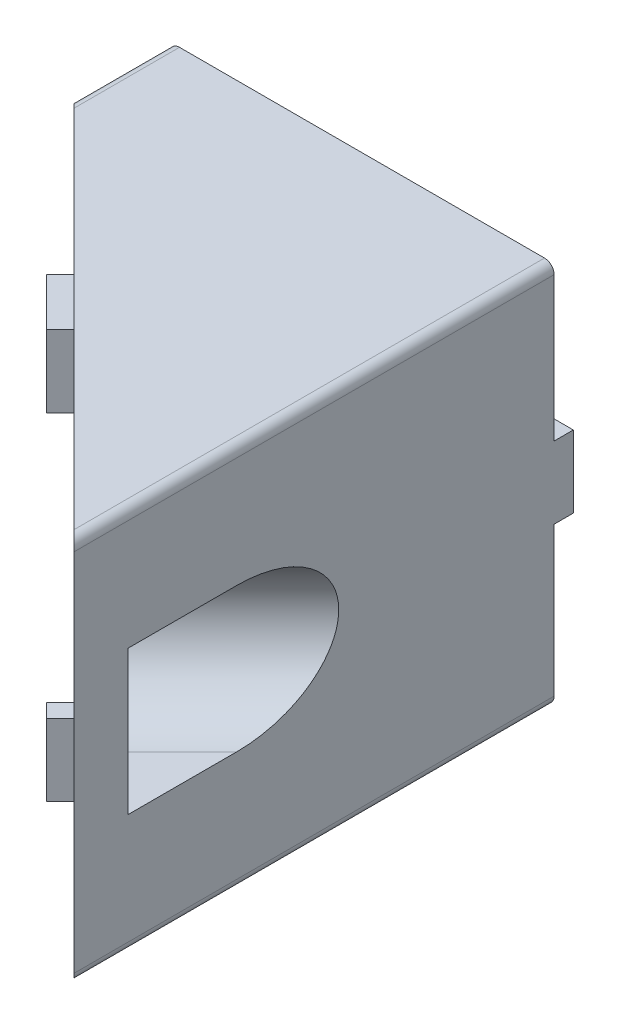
from build123d import *

# Parameters (mm, degrees)
SKETCH_1_W          = 40
SKETCH_1_H          = 40
EXTRUDE_1_DEPTH     = 25
SKETCH_3_R          = 4
CUT_EXTRUDE_1_DEPTH = 50
SKETCH_4_R          = 7.5
CUT_EXTRUDE_2_DEPTH = 42
SKETCH_6_W          = 34
SKETCH_6_H          = 6
CUT_EXTRUDE_4_DEPTH = 36
CUT_EXTRUDE_5_DEPTH = 52.23475383
SKETCH_9_R          = 4.25
CUT_EXTRUDE_6_DEPTH = 41.773766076
CUT_EXTRUDE_7_DEPTH = 36
SKETCH_12_W         = 7
SKETCH_12_H         = 7.5
SKETCH_12_W_2       = 2
EXTRUDE_2_DEPTH     = 2
SKETCH_14_W         = 9
SKETCH_14_H         = 15
CUT_EXTRUDE_8_DEPTH = 53.377117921
SKETCH_16_W         = 11
SKETCH_16_H         = 15
CUT_EXTRUDE_9_DEPTH = 11
SKETCH_17_W         = 2
SKETCH_17_H         = 7.5
EXTRUDE_3_DEPTH     = 2
FILLET_1_R          = 1


with BuildPart() as part:
    # Sketch 1 → Extrude 1 (new, symmetric)
    with BuildSketch(Plane.XY):
        Rectangle(SKETCH_1_W, SKETCH_1_H)
    extrude(amount=EXTRUDE_1_DEPTH, both=True)

    # Sketch 3 → Cut-Extrude 1 (cut)
    with BuildSketch(Plane(origin=(0, 0, -25), x_dir=(-1, 0, 0), z_dir=(0, 0, -1))):
        Circle(SKETCH_3_R)
    extrude(amount=-CUT_EXTRUDE_1_DEPTH, mode=Mode.SUBTRACT)

    # Sketch 4 → Cut-Extrude 2 (cut)
    with BuildSketch(Plane.XY.offset(25)):
        Circle(SKETCH_4_R)
    extrude(amount=-CUT_EXTRUDE_2_DEPTH, mode=Mode.SUBTRACT)

    # Sketch 6 → Cut-Extrude 4 (cut)
    with BuildSketch(Plane.XY.offset(25)):
        with Locations((0, 14)):
            Rectangle(SKETCH_6_W, SKETCH_6_H)
        with Locations((0, -14)):
            Rectangle(SKETCH_6_W, SKETCH_6_H)
    extrude(amount=-CUT_EXTRUDE_4_DEPTH, mode=Mode.SUBTRACT)

    # Sketch 7 → Cut-Extrude 5 (cut, through all)
    with BuildSketch(Plane.XZ.offset(20)):
        Polygon((20, 25), (-20, -15), (-20, 25), align=None)
    extrude(amount=-CUT_EXTRUDE_5_DEPTH, mode=Mode.SUBTRACT)

    # Sketch 9 → Cut-Extrude 6 (cut, through all)
    with BuildSketch(Plane(origin=(-2.5, 0, 2.5), x_dir=(0.7071067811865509, 0, 0.7071067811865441), z_dir=(-0.7071067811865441, 0, 0.7071067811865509))):
        with Locations((19.819805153, 0)):
            Circle(SKETCH_9_R)
    extrude(amount=-CUT_EXTRUDE_6_DEPTH, mode=Mode.SUBTRACT)

    # Sketch 11 → Cut-Extrude 7 (cut)
    with BuildSketch(Plane(origin=(0.328427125, 0, -0.328427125), x_dir=(0.7071067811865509, 0, 0.7071067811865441), z_dir=(-0.7071067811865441, 0, 0.7071067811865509))):
        with BuildLine():
            Line((19.819805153, 7.5), (27.819805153, 7.5))
            Line((27.819805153, 7.5), (27.819805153, -7.5))
            Line((27.819805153, -7.5), (19.819805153, -7.5))
            ThreePointArc((19.819805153, -7.5), (12.319805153, 0), (19.819805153, 7.5))
        make_face()
    extrude(amount=-CUT_EXTRUDE_7_DEPTH, mode=Mode.SUBTRACT)

    # Sketch 12 → Extrude 2 (add)
    with BuildSketch(Plane(origin=(-2.5, 0, 2.5), x_dir=(0.7071067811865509, 0, 0.7071067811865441), z_dir=(-0.7071067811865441, 0, 0.7071067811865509))):
        with Locations((-21.248737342, 0.25)):
            Rectangle(SKETCH_12_W, SKETCH_12_H)
        with Locations((30.819805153, 0.25)):
            Rectangle(SKETCH_12_W_2, SKETCH_12_H)
    extrude(amount=EXTRUDE_2_DEPTH)

    # Sketch 14 → Cut-Extrude 8 (cut, through all)
    with BuildSketch(Plane.XY.offset(-17)):
        with Locations((-4.5, 0)):
            Rectangle(SKETCH_14_W, SKETCH_14_H)
    extrude(amount=CUT_EXTRUDE_8_DEPTH, mode=Mode.SUBTRACT)

    # Sketch 16 → Cut-Extrude 9 (cut)
    with BuildSketch(Plane(origin=(-4.772077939, 0, -4.772077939), x_dir=(0.7071067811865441, 0, -0.7071067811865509), z_dir=(0.7071067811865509, 0, 0.7071067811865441))):
        with Locations((-0.120147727, 0)):
            Rectangle(SKETCH_16_W, SKETCH_16_H)
    extrude(amount=-CUT_EXTRUDE_9_DEPTH, mode=Mode.SUBTRACT)

    # Sketch 17 → Extrude 3 (add)
    with BuildSketch(Plane(origin=(0, 0, -25), x_dir=(-1, 0, 0), z_dir=(0, 0, -1))):
        with Locations((-19, 0.25)):
            Rectangle(SKETCH_17_W, SKETCH_17_H)
        with Locations((19, 0.25)):
            Rectangle(SKETCH_17_W, SKETCH_17_H)
    extrude(amount=EXTRUDE_3_DEPTH)

    # Fillet 1
    fillet_1_edges = [part.edges().sort_by_distance(p)[0] for p in [
        (-20, -20, -20),
        (20, -20, 0),
        (20, 20, 0),
        (-20, 20, -20),
    ]]
    fillet(fillet_1_edges, radius=FILLET_1_R)


solid = part.part
